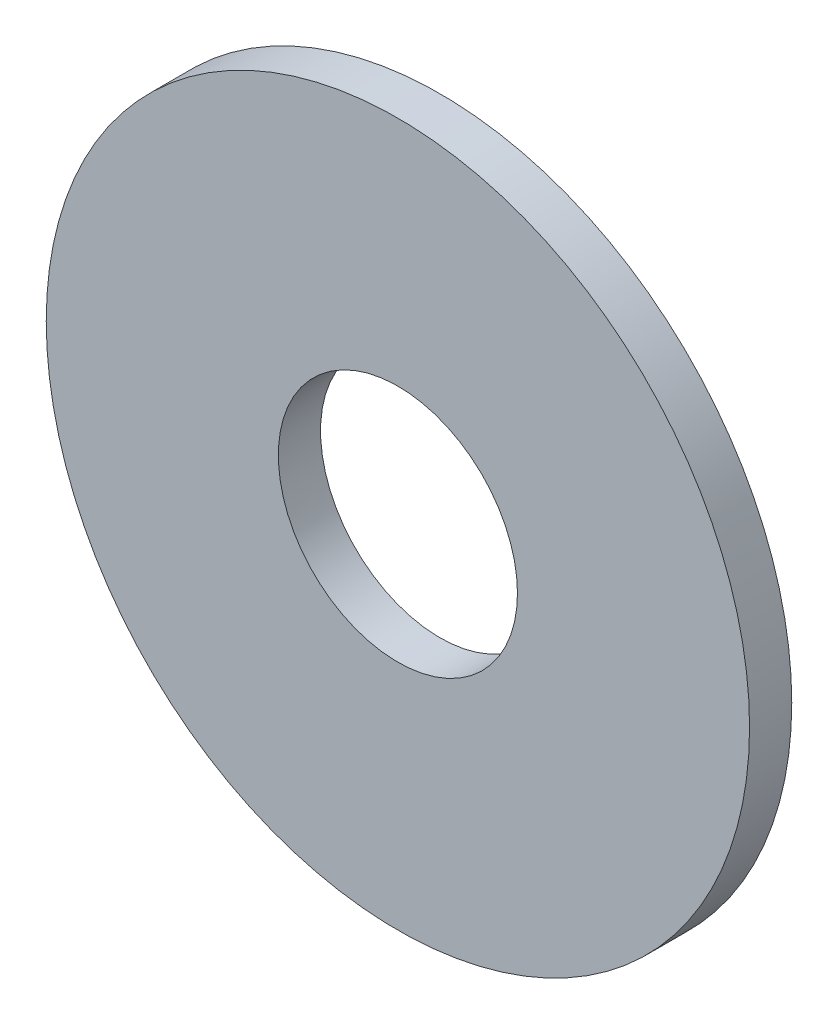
ISO-10303-21;
HEADER;
FILE_DESCRIPTION(('STEP AP214'),'2;1');
FILE_NAME('part.step','',(''),(''),'','','');
FILE_SCHEMA(('AUTOMOTIVE_DESIGN { 1 0 10303 214 1 1 1 1 }'));
ENDSEC;
DATA;
#1=APPLICATION_CONTEXT('core data for automotive mechanical design processes');
#2=APPLICATION_PROTOCOL_DEFINITION('international standard','automotive_design',2000,#1);
#3=PRODUCT_CONTEXT('',#1,'mechanical');
#4=PRODUCT('Part','Part','',(#3));
#5=PRODUCT_RELATED_PRODUCT_CATEGORY('part','',(#4));
#6=PRODUCT_DEFINITION_FORMATION('','',#4);
#7=PRODUCT_DEFINITION_CONTEXT('part definition',#1,'design');
#8=PRODUCT_DEFINITION('design','',#6,#7);
#9=PRODUCT_DEFINITION_SHAPE('','',#8);
#10=(LENGTH_UNIT() NAMED_UNIT(*) SI_UNIT(.MILLI.,.METRE.));
#11=(NAMED_UNIT(*) PLANE_ANGLE_UNIT() SI_UNIT($,.RADIAN.));
#12=(NAMED_UNIT(*) SI_UNIT($,.STERADIAN.) SOLID_ANGLE_UNIT());
#13=UNCERTAINTY_MEASURE_WITH_UNIT(LENGTH_MEASURE(1.E-05),#10,'distance_accuracy_value','');
#14=(GEOMETRIC_REPRESENTATION_CONTEXT(3) GLOBAL_UNCERTAINTY_ASSIGNED_CONTEXT((#13)) GLOBAL_UNIT_ASSIGNED_CONTEXT((#10,
#11,#12)) REPRESENTATION_CONTEXT('',''));
#15=CARTESIAN_POINT('',(0.,0.,0.));
#16=DIRECTION('',(0.,0.,1.));
#17=DIRECTION('',(1.,0.,0.));
#18=AXIS2_PLACEMENT_3D('',#15,#16,#17);
#19=CARTESIAN_POINT('',(0.,0.,3.));
#20=DIRECTION('',(0.,0.,1.));
#21=DIRECTION('',(1.,0.,0.));
#22=AXIS2_PLACEMENT_3D('',#19,#20,#21);
#23=PLANE('',#22);
#24=CARTESIAN_POINT('',(0.,0.,3.));
#25=DIRECTION('',(0.,0.,1.));
#26=DIRECTION('',(1.,0.,0.));
#27=AXIS2_PLACEMENT_3D('',#24,#25,#26);
#28=CIRCLE('',#27,25.);
#29=CARTESIAN_POINT('',(25.,0.,3.));
#30=VERTEX_POINT('',#29);
#31=EDGE_CURVE('E10',#30,#30,#28,.T.);
#32=ORIENTED_EDGE('',*,*,#31,.T.);
#33=EDGE_LOOP('',(#32));
#34=FACE_BOUND('',#33,.T.);
#35=CARTESIAN_POINT('',(0.,0.,3.));
#36=DIRECTION('',(0.,0.,1.));
#37=DIRECTION('',(1.,0.,0.));
#38=AXIS2_PLACEMENT_3D('',#35,#36,#37);
#39=CIRCLE('',#38,8.5);
#40=CARTESIAN_POINT('',(8.5,0.,3.));
#41=VERTEX_POINT('',#40);
#42=EDGE_CURVE('E44',#41,#41,#39,.T.);
#43=ORIENTED_EDGE('',*,*,#42,.F.);
#44=EDGE_LOOP('',(#43));
#45=FACE_BOUND('',#44,.T.);
#46=ADVANCED_FACE('F33',(#34,#45),#23,.T.);
#47=CARTESIAN_POINT('',(0.,0.,0.));
#48=DIRECTION('',(0.,0.,1.));
#49=DIRECTION('',(1.,0.,0.));
#50=AXIS2_PLACEMENT_3D('',#47,#48,#49);
#51=PLANE('',#50);
#52=CARTESIAN_POINT('',(0.,0.,0.));
#53=DIRECTION('',(0.,0.,1.));
#54=DIRECTION('',(1.,0.,0.));
#55=AXIS2_PLACEMENT_3D('',#52,#53,#54);
#56=CIRCLE('',#55,25.);
#57=CARTESIAN_POINT('',(25.,0.,0.));
#58=VERTEX_POINT('',#57);
#59=EDGE_CURVE('E37',#58,#58,#56,.T.);
#60=ORIENTED_EDGE('',*,*,#59,.F.);
#61=EDGE_LOOP('',(#60));
#62=FACE_BOUND('',#61,.T.);
#63=CARTESIAN_POINT('',(0.,0.,0.));
#64=DIRECTION('',(0.,0.,1.));
#65=DIRECTION('',(1.,0.,0.));
#66=AXIS2_PLACEMENT_3D('',#63,#64,#65);
#67=CIRCLE('',#66,8.5);
#68=CARTESIAN_POINT('',(8.5,0.,0.));
#69=VERTEX_POINT('',#68);
#70=EDGE_CURVE('E46',#69,#69,#67,.T.);
#71=ORIENTED_EDGE('',*,*,#70,.T.);
#72=EDGE_LOOP('',(#71));
#73=FACE_BOUND('',#72,.T.);
#74=ADVANCED_FACE('F56',(#62,#73),#51,.F.);
#75=CARTESIAN_POINT('',(0.,0.,3.));
#76=DIRECTION('',(0.,0.,-1.));
#77=DIRECTION('',(-1.,0.,0.));
#78=AXIS2_PLACEMENT_3D('',#75,#76,#77);
#79=CYLINDRICAL_SURFACE('',#78,25.);
#80=ORIENTED_EDGE('',*,*,#31,.F.);
#81=EDGE_LOOP('',(#80));
#82=FACE_BOUND('',#81,.T.);
#83=ORIENTED_EDGE('',*,*,#59,.T.);
#84=EDGE_LOOP('',(#83));
#85=FACE_BOUND('',#84,.T.);
#86=ADVANCED_FACE('F35',(#82,#85),#79,.T.);
#87=CARTESIAN_POINT('',(0.,0.,3.));
#88=DIRECTION('',(0.,0.,-1.));
#89=DIRECTION('',(-1.,0.,0.));
#90=AXIS2_PLACEMENT_3D('',#87,#88,#89);
#91=CYLINDRICAL_SURFACE('',#90,8.5);
#92=ORIENTED_EDGE('',*,*,#42,.T.);
#93=EDGE_LOOP('',(#92));
#94=FACE_BOUND('',#93,.T.);
#95=ORIENTED_EDGE('',*,*,#70,.F.);
#96=EDGE_LOOP('',(#95));
#97=FACE_BOUND('',#96,.T.);
#98=ADVANCED_FACE('F52',(#94,#97),#91,.F.);
#99=CLOSED_SHELL('',(#46,#74,#86,#98));
#100=MANIFOLD_SOLID_BREP('B2',#99);
#101=ADVANCED_BREP_SHAPE_REPRESENTATION('',(#18,#100),#14);
#102=SHAPE_DEFINITION_REPRESENTATION(#9,#101);
ENDSEC;
END-ISO-10303-21;
